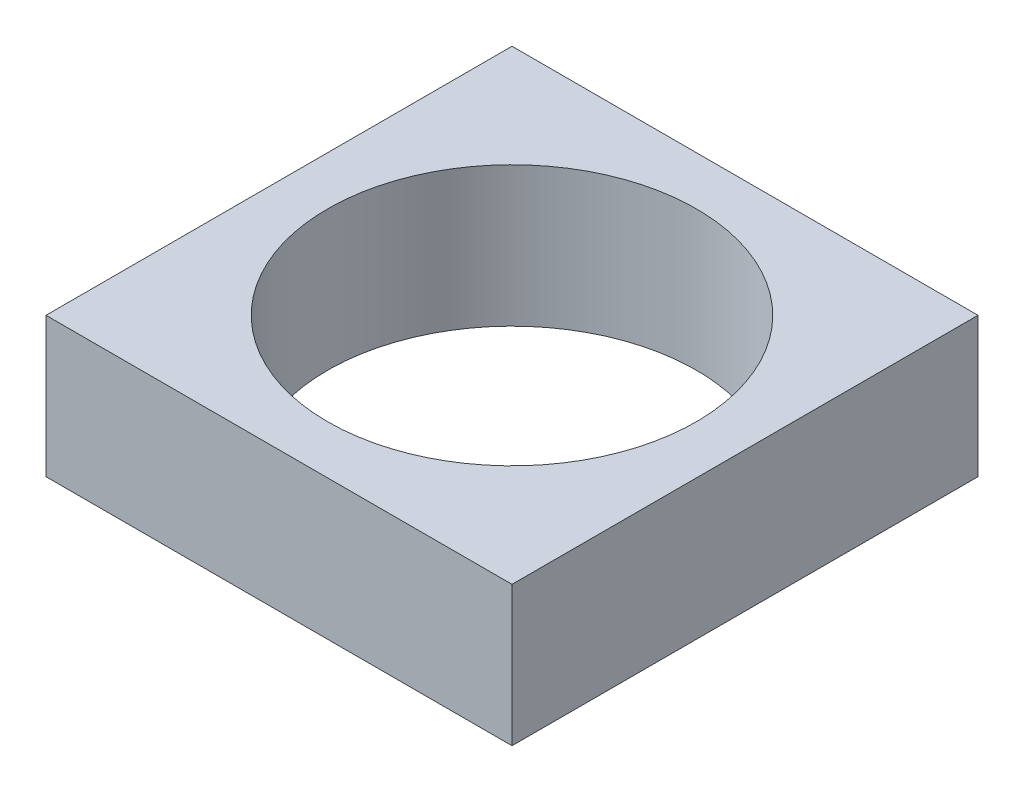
ISO-10303-21;
HEADER;
FILE_DESCRIPTION(('STEP AP214'),'2;1');
FILE_NAME('part.step','',(''),(''),'','','');
FILE_SCHEMA(('AUTOMOTIVE_DESIGN { 1 0 10303 214 1 1 1 1 }'));
ENDSEC;
DATA;
#1=APPLICATION_CONTEXT('core data for automotive mechanical design processes');
#2=APPLICATION_PROTOCOL_DEFINITION('international standard','automotive_design',2000,#1);
#3=PRODUCT_CONTEXT('',#1,'mechanical');
#4=PRODUCT('Part','Part','',(#3));
#5=PRODUCT_RELATED_PRODUCT_CATEGORY('part','',(#4));
#6=PRODUCT_DEFINITION_FORMATION('','',#4);
#7=PRODUCT_DEFINITION_CONTEXT('part definition',#1,'design');
#8=PRODUCT_DEFINITION('design','',#6,#7);
#9=PRODUCT_DEFINITION_SHAPE('','',#8);
#10=(LENGTH_UNIT() NAMED_UNIT(*) SI_UNIT(.MILLI.,.METRE.));
#11=(NAMED_UNIT(*) PLANE_ANGLE_UNIT() SI_UNIT($,.RADIAN.));
#12=(NAMED_UNIT(*) SI_UNIT($,.STERADIAN.) SOLID_ANGLE_UNIT());
#13=UNCERTAINTY_MEASURE_WITH_UNIT(LENGTH_MEASURE(1.E-05),#10,'distance_accuracy_value','');
#14=(GEOMETRIC_REPRESENTATION_CONTEXT(3) GLOBAL_UNCERTAINTY_ASSIGNED_CONTEXT((#13)) GLOBAL_UNIT_ASSIGNED_CONTEXT((#10,
#11,#12)) REPRESENTATION_CONTEXT('',''));
#15=CARTESIAN_POINT('',(0.,0.,0.));
#16=DIRECTION('',(0.,0.,1.));
#17=DIRECTION('',(1.,0.,0.));
#18=AXIS2_PLACEMENT_3D('',#15,#16,#17);
#19=CARTESIAN_POINT('',(0.,300.,0.));
#20=DIRECTION('',(0.,1.,0.));
#21=DIRECTION('',(0.,0.,1.));
#22=AXIS2_PLACEMENT_3D('',#19,#20,#21);
#23=PLANE('',#22);
#24=DIRECTION('',(0.,0.,1.));
#25=VECTOR('',#24,1.);
#26=CARTESIAN_POINT('',(-500.,300.,500.));
#27=LINE('',#26,#25);
#28=CARTESIAN_POINT('',(-500.,300.,-500.));
#29=VERTEX_POINT('',#28);
#30=CARTESIAN_POINT('',(-500.,300.,500.));
#31=VERTEX_POINT('',#30);
#32=EDGE_CURVE('E85',#29,#31,#27,.T.);
#33=ORIENTED_EDGE('',*,*,#32,.T.);
#34=DIRECTION('',(1.,0.,0.));
#35=VECTOR('',#34,1.);
#36=CARTESIAN_POINT('',(500.,300.,500.));
#37=LINE('',#36,#35);
#38=CARTESIAN_POINT('',(500.,300.,500.));
#39=VERTEX_POINT('',#38);
#40=EDGE_CURVE('E80',#31,#39,#37,.T.);
#41=ORIENTED_EDGE('',*,*,#40,.T.);
#42=DIRECTION('',(0.,0.,-1.));
#43=VECTOR('',#42,1.);
#44=CARTESIAN_POINT('',(500.,300.,500.));
#45=LINE('',#44,#43);
#46=CARTESIAN_POINT('',(500.,300.,-500.));
#47=VERTEX_POINT('',#46);
#48=EDGE_CURVE('E83',#39,#47,#45,.T.);
#49=ORIENTED_EDGE('',*,*,#48,.T.);
#50=DIRECTION('',(-1.,0.,0.));
#51=VECTOR('',#50,1.);
#52=CARTESIAN_POINT('',(500.,300.,-500.));
#53=LINE('',#52,#51);
#54=EDGE_CURVE('E50',#47,#29,#53,.T.);
#55=ORIENTED_EDGE('',*,*,#54,.T.);
#56=EDGE_LOOP('',(#33,#41,#49,#55));
#57=FACE_BOUND('',#56,.T.);
#58=CARTESIAN_POINT('',(1.11022302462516E-13,300.,0.));
#59=DIRECTION('',(0.,1.,0.));
#60=DIRECTION('',(0.,0.,1.));
#61=AXIS2_PLACEMENT_3D('',#58,#59,#60);
#62=CIRCLE('',#61,395.691608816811);
#63=CARTESIAN_POINT('',(1.11022302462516E-13,300.,395.691608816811));
#64=VERTEX_POINT('',#63);
#65=EDGE_CURVE('E100',#64,#64,#62,.T.);
#66=ORIENTED_EDGE('',*,*,#65,.F.);
#67=EDGE_LOOP('',(#66));
#68=FACE_BOUND('',#67,.T.);
#69=ADVANCED_FACE('F33',(#57,#68),#23,.T.);
#70=CARTESIAN_POINT('',(0.,0.,0.));
#71=DIRECTION('',(0.,1.,0.));
#72=DIRECTION('',(0.,0.,1.));
#73=AXIS2_PLACEMENT_3D('',#70,#71,#72);
#74=PLANE('',#73);
#75=DIRECTION('',(0.,0.,1.));
#76=VECTOR('',#75,1.);
#77=CARTESIAN_POINT('',(-500.,0.,500.));
#78=LINE('',#77,#76);
#79=CARTESIAN_POINT('',(-500.,0.,-500.));
#80=VERTEX_POINT('',#79);
#81=CARTESIAN_POINT('',(-500.,0.,500.));
#82=VERTEX_POINT('',#81);
#83=EDGE_CURVE('E97',#80,#82,#78,.T.);
#84=ORIENTED_EDGE('',*,*,#83,.F.);
#85=DIRECTION('',(-1.,0.,0.));
#86=VECTOR('',#85,1.);
#87=CARTESIAN_POINT('',(500.,0.,-500.));
#88=LINE('',#87,#86);
#89=CARTESIAN_POINT('',(500.,0.,-500.));
#90=VERTEX_POINT('',#89);
#91=EDGE_CURVE('E73',#90,#80,#88,.T.);
#92=ORIENTED_EDGE('',*,*,#91,.F.);
#93=DIRECTION('',(0.,0.,-1.));
#94=VECTOR('',#93,1.);
#95=CARTESIAN_POINT('',(500.,0.,500.));
#96=LINE('',#95,#94);
#97=CARTESIAN_POINT('',(500.,0.,500.));
#98=VERTEX_POINT('',#97);
#99=EDGE_CURVE('E67',#98,#90,#96,.T.);
#100=ORIENTED_EDGE('',*,*,#99,.F.);
#101=DIRECTION('',(1.,0.,0.));
#102=VECTOR('',#101,1.);
#103=CARTESIAN_POINT('',(500.,0.,500.));
#104=LINE('',#103,#102);
#105=EDGE_CURVE('E89',#82,#98,#104,.T.);
#106=ORIENTED_EDGE('',*,*,#105,.F.);
#107=EDGE_LOOP('',(#84,#92,#100,#106));
#108=FACE_BOUND('',#107,.T.);
#109=CARTESIAN_POINT('',(1.11022302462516E-13,0.,0.));
#110=DIRECTION('',(0.,1.,0.));
#111=DIRECTION('',(0.,0.,1.));
#112=AXIS2_PLACEMENT_3D('',#109,#110,#111);
#113=CIRCLE('',#112,395.691608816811);
#114=CARTESIAN_POINT('',(1.11022302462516E-13,0.,395.691608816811));
#115=VERTEX_POINT('',#114);
#116=EDGE_CURVE('E112',#115,#115,#113,.T.);
#117=ORIENTED_EDGE('',*,*,#116,.T.);
#118=EDGE_LOOP('',(#117));
#119=FACE_BOUND('',#118,.T.);
#120=ADVANCED_FACE('F108',(#108,#119),#74,.F.);
#121=CARTESIAN_POINT('',(-500.,300.,500.));
#122=DIRECTION('',(1.,0.,0.));
#123=DIRECTION('',(0.,0.,-1.));
#124=AXIS2_PLACEMENT_3D('',#121,#122,#123);
#125=PLANE('',#124);
#126=ORIENTED_EDGE('',*,*,#83,.T.);
#127=DIRECTION('',(0.,-1.,0.));
#128=VECTOR('',#127,1.);
#129=CARTESIAN_POINT('',(-500.,300.,500.));
#130=LINE('',#129,#128);
#131=EDGE_CURVE('E11',#31,#82,#130,.T.);
#132=ORIENTED_EDGE('',*,*,#131,.F.);
#133=ORIENTED_EDGE('',*,*,#32,.F.);
#134=DIRECTION('',(0.,-1.,0.));
#135=VECTOR('',#134,1.);
#136=CARTESIAN_POINT('',(-500.,300.,-500.));
#137=LINE('',#136,#135);
#138=EDGE_CURVE('E93',#29,#80,#137,.T.);
#139=ORIENTED_EDGE('',*,*,#138,.T.);
#140=EDGE_LOOP('',(#126,#132,#133,#139));
#141=FACE_BOUND('',#140,.T.);
#142=ADVANCED_FACE('F35',(#141),#125,.F.);
#143=CARTESIAN_POINT('',(500.,300.,500.));
#144=DIRECTION('',(0.,0.,-1.));
#145=DIRECTION('',(-1.,0.,0.));
#146=AXIS2_PLACEMENT_3D('',#143,#144,#145);
#147=PLANE('',#146);
#148=ORIENTED_EDGE('',*,*,#105,.T.);
#149=DIRECTION('',(0.,-1.,0.));
#150=VECTOR('',#149,1.);
#151=CARTESIAN_POINT('',(500.,300.,500.));
#152=LINE('',#151,#150);
#153=EDGE_CURVE('E42',#39,#98,#152,.T.);
#154=ORIENTED_EDGE('',*,*,#153,.F.);
#155=ORIENTED_EDGE('',*,*,#40,.F.);
#156=ORIENTED_EDGE('',*,*,#131,.T.);
#157=EDGE_LOOP('',(#148,#154,#155,#156));
#158=FACE_BOUND('',#157,.T.);
#159=ADVANCED_FACE('F88',(#158),#147,.F.);
#160=CARTESIAN_POINT('',(500.,300.,500.));
#161=DIRECTION('',(-1.,0.,0.));
#162=DIRECTION('',(0.,0.,1.));
#163=AXIS2_PLACEMENT_3D('',#160,#161,#162);
#164=PLANE('',#163);
#165=ORIENTED_EDGE('',*,*,#99,.T.);
#166=DIRECTION('',(0.,-1.,0.));
#167=VECTOR('',#166,1.);
#168=CARTESIAN_POINT('',(500.,300.,-500.));
#169=LINE('',#168,#167);
#170=EDGE_CURVE('E90',#47,#90,#169,.T.);
#171=ORIENTED_EDGE('',*,*,#170,.F.);
#172=ORIENTED_EDGE('',*,*,#48,.F.);
#173=ORIENTED_EDGE('',*,*,#153,.T.);
#174=EDGE_LOOP('',(#165,#171,#172,#173));
#175=FACE_BOUND('',#174,.T.);
#176=ADVANCED_FACE('F91',(#175),#164,.F.);
#177=CARTESIAN_POINT('',(500.,300.,-500.));
#178=DIRECTION('',(0.,0.,1.));
#179=DIRECTION('',(1.,0.,0.));
#180=AXIS2_PLACEMENT_3D('',#177,#178,#179);
#181=PLANE('',#180);
#182=ORIENTED_EDGE('',*,*,#91,.T.);
#183=ORIENTED_EDGE('',*,*,#138,.F.);
#184=ORIENTED_EDGE('',*,*,#54,.F.);
#185=ORIENTED_EDGE('',*,*,#170,.T.);
#186=EDGE_LOOP('',(#182,#183,#184,#185));
#187=FACE_BOUND('',#186,.T.);
#188=ADVANCED_FACE('F105',(#187),#181,.F.);
#189=CARTESIAN_POINT('',(1.11022302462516E-13,300.,0.));
#190=DIRECTION('',(0.,-1.,0.));
#191=DIRECTION('',(0.,0.,-1.));
#192=AXIS2_PLACEMENT_3D('',#189,#190,#191);
#193=CYLINDRICAL_SURFACE('',#192,395.691608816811);
#194=ORIENTED_EDGE('',*,*,#65,.T.);
#195=EDGE_LOOP('',(#194));
#196=FACE_BOUND('',#195,.T.);
#197=ORIENTED_EDGE('',*,*,#116,.F.);
#198=EDGE_LOOP('',(#197));
#199=FACE_BOUND('',#198,.T.);
#200=ADVANCED_FACE('F118',(#196,#199),#193,.F.);
#201=CLOSED_SHELL('',(#69,#120,#142,#159,#176,#188,#200));
#202=MANIFOLD_SOLID_BREP('B2',#201);
#203=ADVANCED_BREP_SHAPE_REPRESENTATION('',(#18,#202),#14);
#204=SHAPE_DEFINITION_REPRESENTATION(#9,#203);
ENDSEC;
END-ISO-10303-21;
